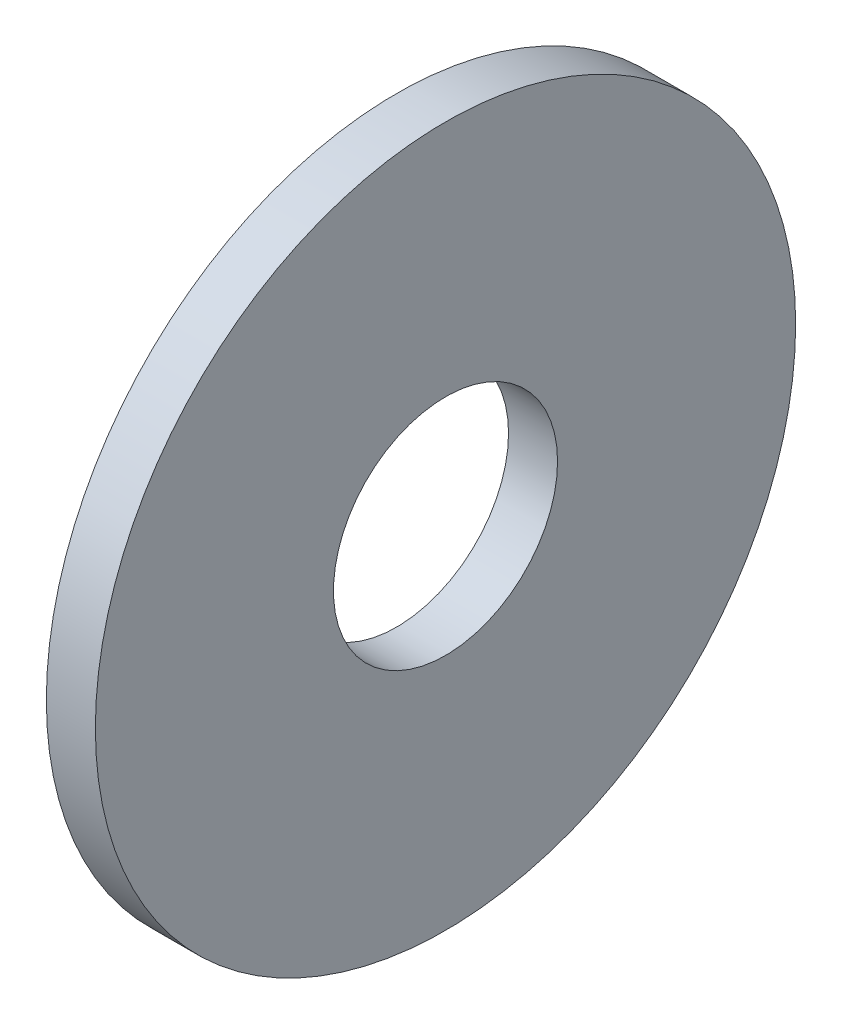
from build123d import *

# Parameters (mm, degrees)
SKETCH1_R           = 10
SKETCH1_R_2         = 3.2
BOSS_EXTRUDE1_DEPTH = 1.4


with BuildPart() as part:
    # Sketch1 → Boss-Extrude1 (new body)
    with BuildSketch(Plane(origin=(0, 0, 0), x_dir=(0, 0, -1), z_dir=(1, 0, 0))):
        Circle(SKETCH1_R)
        Circle(SKETCH1_R_2, mode=Mode.SUBTRACT)
    extrude(amount=BOSS_EXTRUDE1_DEPTH)


solid = part.part
